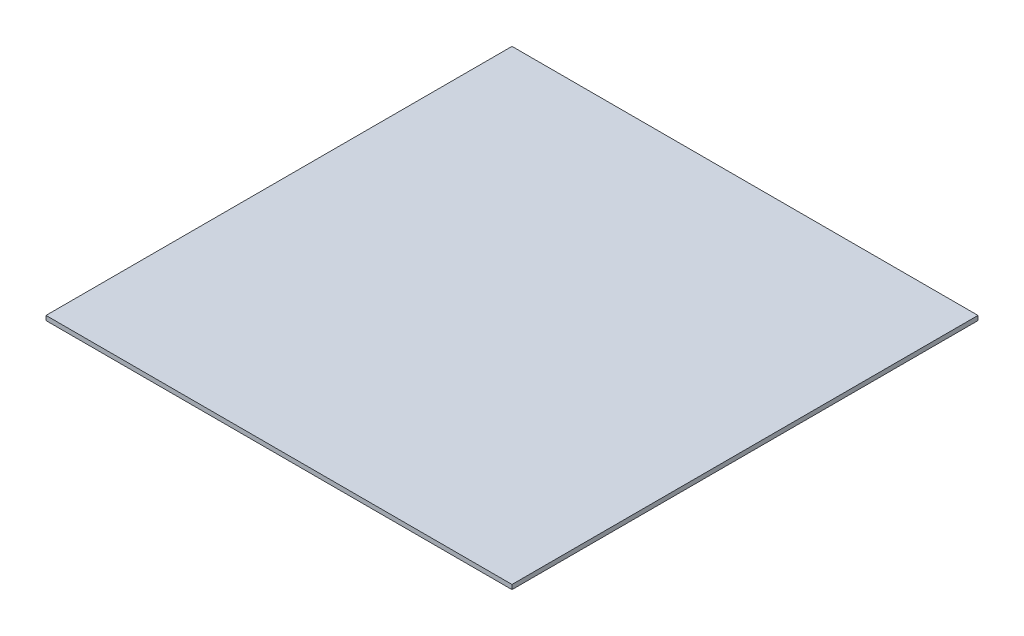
from build123d import *

# Parameters (mm, degrees)
SKIZZE1_W                       = 310
SKIZZE1_H                       = 310
AUFSATZ_LINEAR_AUSTRAGEN1_DEPTH = 3


with BuildPart() as part:
    # Skizze1 → Aufsatz-Linear austragen1 (new body)
    with BuildSketch(Plane(origin=(0, 0, 0), x_dir=(1, 0, 0), z_dir=(0, 1, 0))):
        Rectangle(SKIZZE1_W, SKIZZE1_H)
    extrude(amount=AUFSATZ_LINEAR_AUSTRAGEN1_DEPTH)


solid = part.part
